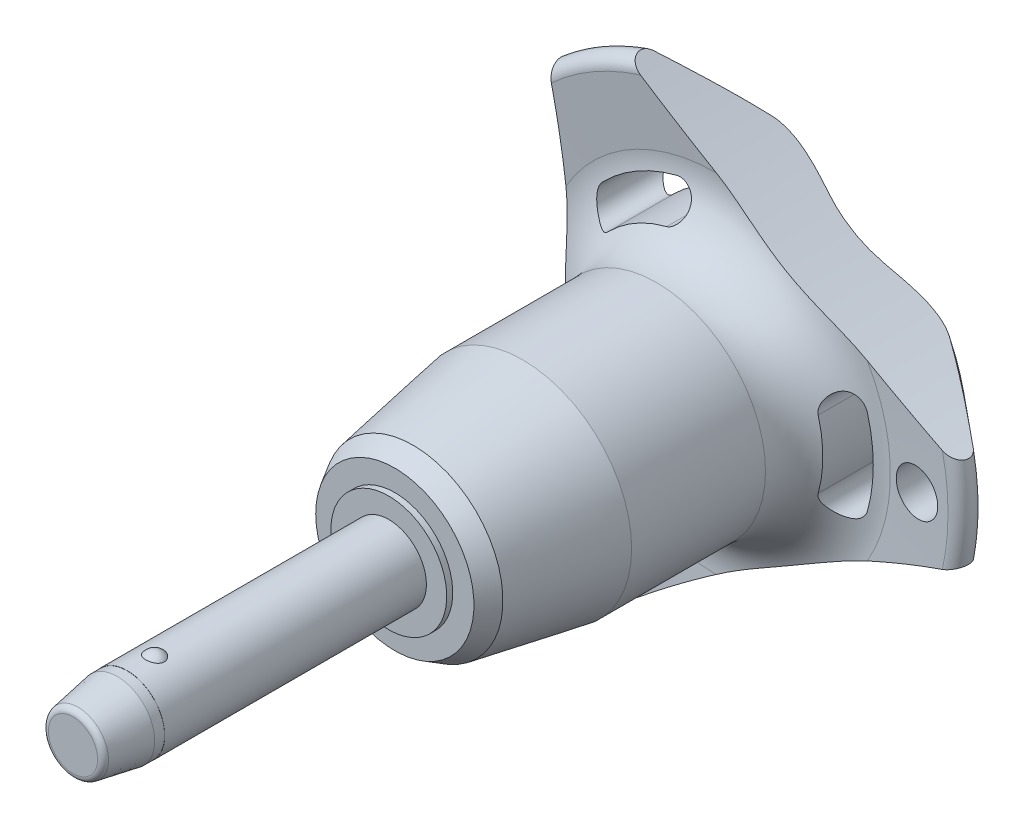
from build123d import *

# Parameters (mm, degrees)
SKETCH1_R           = 2.5
BOSS_EXTRUDE1_DEPTH = 15
SKETCH2_R           = 2.1
BOSS_EXTRUDE2_DEPTH = 26.7
BOSS_EXTRUDE3_START = 6
SKETCH1_2_R         = 2.5
BOSS_EXTRUDE3_DEPTH = 6
CHAMFER1_SIZE       = 3
CHAMFER1_SIZE2      = 0.528980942
FILLET1_R           = 0.4
SKETCH6_R           = 79.96
CUT_EXTRUDE1_DEPTH  = 48.854696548
CIRPATTERN1_COUNT   = 3
SKETCH7_R           = 1.5
CUT_EXTRUDE2_DEPTH  = 48.535566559
SKETCH8_R           = 2.5
SKETCH8_R_2         = 2.49
CUT_EXTRUDE3_DEPTH  = 3.6


with BuildPart() as part:
    # Sketch1 → Boss-Extrude1 (new body)
    with BuildSketch(Plane.XY):
        Circle(SKETCH1_R)
    extrude(amount=-BOSS_EXTRUDE1_DEPTH)

    # Sketch2 → Boss-Extrude2 (add)
    with BuildSketch(Plane(origin=(0, 0, -15), x_dir=(-1, 0, 0), z_dir=(0, 0, -1))):
        Circle(SKETCH2_R)
    extrude(amount=BOSS_EXTRUDE2_DEPTH)

    # Sketch3 → Revolve1 (revolve)
    with BuildSketch(Plane(origin=(0, 0, 0), x_dir=(0, 0, -1), z_dir=(1, 0, 0))):
        with BuildLine():
            Line((-0.580947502, 2.75), (-0.580947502, 1.15))
            ThreePointArc((-0.580947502, 1.15), (0.219052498, 1.95), (-0.580947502, 2.75))
        make_face()
        with BuildLine():
            Line((-0.580947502, -1.15), (-0.580947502, -2.75))
            ThreePointArc((-0.580947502, -2.75), (0.219052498, -1.95), (-0.580947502, -1.15))
        make_face()
    revolve(axis=Axis((0, -1.15, 0.580947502), (0, 1, 0)))

    # Sketch1_2 → Boss-Extrude3 (add)
    with BuildSketch(Plane.XY.offset(BOSS_EXTRUDE3_START)):
        Circle(SKETCH1_2_R)
    extrude(amount=-BOSS_EXTRUDE3_DEPTH)

    # Chamfer1
    chamfer1_edges = [part.edges().sort_by_distance(p)[0] for p in [
        (-2.5, 0, 6),
    ]]
    chamfer1_side = [part.faces().sort_by_distance(p)[0] for p in [
        (-2.5, 0, -4.5),
    ]]
    chamfer(chamfer1_edges, length=CHAMFER1_SIZE, length2=CHAMFER1_SIZE2, reference=chamfer1_side[0])

    # Fillet1
    fillet1_edges = [part.edges().sort_by_distance(p)[0] for p in [
        (-1.971019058, 0, 6),
        (2.1, 0, -41.7),
    ]]
    fillet(fillet1_edges, radius=FILLET1_R)

    # Sketch4 → Revolve2 (revolve)
    with BuildSketch(Plane(origin=(0, 0, 0), x_dir=(0, 0, -1), z_dir=(1, 0, 0)), mode=Mode.PRIVATE) as revolve2_sk:
        Polygon((15, 0), (15, 3.851837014), (15.4, 3.851837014), (15.4, 5.26161122), (16.620900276, 5.966498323), (23.9, 7.25), (32.8, 7.25), (32.8, 0), align=None)
    revolve(revolve2_sk.sketch.rotate(Axis((0, 0, -32.8), (0, 0, 1)), 90), axis=Axis((0, 0, -32.8), (0, 0, 1)))

    # Sketch5 → Revolve3 (revolve)
    with BuildSketch(Plane(origin=(0, 0, 0), x_dir=(0, 0, -1), z_dir=(1, 0, 0)), mode=Mode.PRIVATE) as revolve3_sk:
        with BuildLine():
            Line((36.78715932, 11.570250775), (36.452568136, 15.735949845))
            ThreePointArc((36.452568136, 15.735949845), (36.946485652, 16.540188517), (37.862835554, 16.314230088))
            Line((37.862835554, 16.314230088), (41.326414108, 12.186497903))
            ThreePointArc((41.326414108, 12.186497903), (41.7, 11.109282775), (41.261488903, 10.056825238))
            ThreePointArc((41.261488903, 10.056825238), (38.289873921, 5.413681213), (37.25, 0))
            Line((37.25, 0), (32.8, 0))
            Line((32.8, 0), (32.8, 7.25))
            ThreePointArc((32.8, 7.25), (35.739473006, 8.537160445), (36.78715932, 11.570250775))
        make_face()
    revolve(revolve3_sk.sketch.rotate(Axis((0, 0, -37.25), (0, 0, 1)), 90), axis=Axis((0, 0, -37.25), (0, 0, 1)))

    # Sketch6 → Cut-Extrude1 (cut, through all)
    with BuildSketch(Plane.XY):
        with Locations((-89.76, 0)):
            Circle(SKETCH6_R)
        with BuildLine():
            ThreePointArc((10.099921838, -2.834717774), (10.490188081, 0), (10.099921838, 2.834717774))
            ThreePointArc((10.099921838, 2.834717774), (8.768180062, 3.582738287), (8.020159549, 2.250996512))
            ThreePointArc((8.020159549, 2.250996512), (8.330062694, 0), (8.020159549, -2.250996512))
            ThreePointArc((8.020159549, -2.250996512), (8.768180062, -3.582738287), (10.099921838, -2.834717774))
        make_face()
    cut_extrude1 = extrude(amount=-CUT_EXTRUDE1_DEPTH, mode=Mode.SUBTRACT)

    # CirPattern1: Cut-Extrude1 ×3 about axis
    cirpattern1_axis = Axis((0, 0, 0), (0, 0, 1))
    for i in range(1, CIRPATTERN1_COUNT):
        add(cut_extrude1.rotate(cirpattern1_axis, i * 360 / CIRPATTERN1_COUNT), mode=Mode.SUBTRACT)

    # Sketch7 → Cut-Extrude2 (cut, through all)
    with BuildSketch(Plane.XY):
        with Locations(Location((13.490188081, 0, 0), (0, 0, 225.221865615))):
            Circle(SKETCH7_R)
    extrude(amount=-CUT_EXTRUDE2_DEPTH, mode=Mode.SUBTRACT)

    # Sketch8 → Cut-Extrude3 (cut)
    with BuildSketch(Plane.XY.offset(6)):
        Circle(SKETCH8_R)
        Circle(SKETCH8_R_2, mode=Mode.SUBTRACT)
    extrude(amount=-CUT_EXTRUDE3_DEPTH, mode=Mode.SUBTRACT)


solid = part.part
